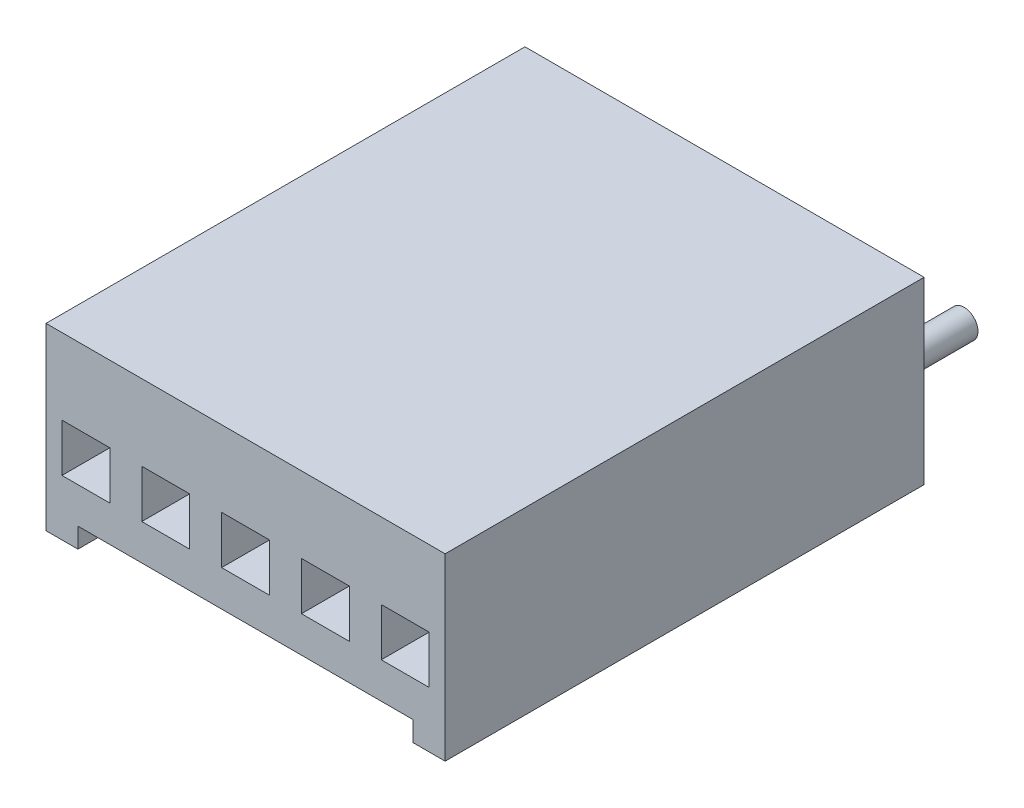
from build123d import *

# Parameters (mm, degrees)
SKETCH2_W           = 12.7
SKETCH2_H           = 5.715
BOSS_EXTRUDE2_DEPTH = 2.54
SKETCH3_W           = 10.16
SKETCH3_H           = 0.635
BOSS_EXTRUDE3_DEPTH = 7.62
SKETCH4_W           = 12.7
SKETCH4_H           = 5.08
BOSS_EXTRUDE4_DEPTH = 12.7
SKETCH5_R           = 0.4445
BOSS_EXTRUDE5_DEPTH = 2.54
SKETCH_2_W          = 1.016
SKETCH_2_H          = 12.7
EXTRUDE_1_DEPTH     = 0.635
SKETCH_3_W          = 1.524
SKETCH_3_H          = 1.524
CUT_EXTRUDE_1_DEPTH = 12.7


with BuildPart() as part:
    # Sketch2 → Boss-Extrude2 (new body)
    with BuildSketch(Plane.XY):
        with Locations((5.08, 0.3175)):
            Rectangle(SKETCH2_W, SKETCH2_H)
    extrude(amount=BOSS_EXTRUDE2_DEPTH)

    # Sketch3 → Boss-Extrude3 (add)
    with BuildSketch(Plane.XY.offset(2.54)):
        with Locations((5.08, -2.2225)):
            Rectangle(SKETCH3_W, SKETCH3_H)
    extrude(amount=BOSS_EXTRUDE3_DEPTH)

    # Sketch4 → Boss-Extrude4 (add)
    with BuildSketch(Plane.XY.offset(2.54)):
        with Locations((5.08, 0.635)):
            Rectangle(SKETCH4_W, SKETCH4_H)
    extrude(amount=BOSS_EXTRUDE4_DEPTH)

    # Sketch5 → Boss-Extrude5 (add)
    with BuildSketch(Plane(origin=(0, 0, 0), x_dir=(-1, 0, 0), z_dir=(0, 0, -1))):
        with Locations(Location((0, 0, 0), (0, 0, 180))):
            Circle(SKETCH5_R)
        with Locations(Location((-2.54, 0, 0), (0, 0, 180))):
            Circle(SKETCH5_R)
        with Locations(Location((-5.08, 0, 0), (0, 0, 180))):
            Circle(SKETCH5_R)
        with Locations(Location((-7.62, 0, 0), (0, 0, 180))):
            Circle(SKETCH5_R)
        with Locations(Location((-10.16, 0, 0), (0, 0, 180))):
            Circle(SKETCH5_R)
    extrude(amount=BOSS_EXTRUDE5_DEPTH)

    # Sketch 2 → Extrude 1 (add)
    with BuildSketch(Plane.XZ.offset(1.905)):
        with Locations((-0.762, 8.89)):
            Rectangle(SKETCH_2_W, SKETCH_2_H)
        with Locations((10.922, 8.89)):
            Rectangle(SKETCH_2_W, SKETCH_2_H)
    extrude(amount=EXTRUDE_1_DEPTH)

    # Sketch 3 → Cut-Extrude 1 (cut)
    with BuildSketch(Plane.XY.offset(15.24)):
        Rectangle(SKETCH_3_W, SKETCH_3_H)
        with Locations((2.54, 0)):
            Rectangle(SKETCH_3_W, SKETCH_3_H)
        with Locations((5.08, 0)):
            Rectangle(SKETCH_3_W, SKETCH_3_H)
        with Locations((7.62, 0)):
            Rectangle(SKETCH_3_W, SKETCH_3_H)
        with Locations((10.16, 0)):
            Rectangle(SKETCH_3_W, SKETCH_3_H)
    extrude(amount=-CUT_EXTRUDE_1_DEPTH, mode=Mode.SUBTRACT)


solid = part.part
